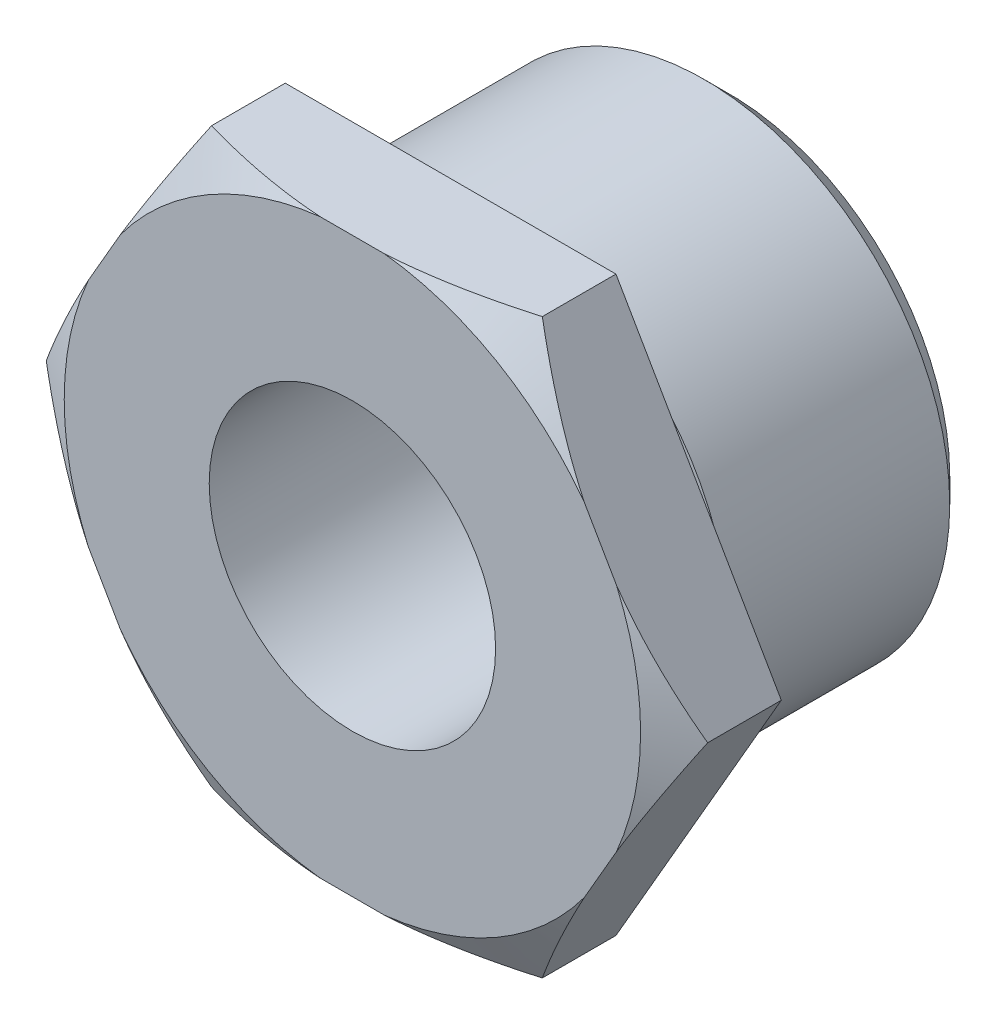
from build123d import *

# Parameters (mm, degrees)
BASE_EXTRUSION_DEPTH    = 6
ESQUISSE4_R             = 8.75
ENL_V_MAT_EXTRU_1_DEPTH = 36.264476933


with BuildPart() as part:
    # Esquisse1 → Base-Extrusion (new body)
    with BuildSketch(Plane.XY):
        Polygon((-20.207259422, 0), (-10.103629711, -17.5), (10.103629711, -17.5), (20.207259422, 0), (10.103629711, 17.5), (-10.103629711, 17.5), align=None)
    extrude(amount=BASE_EXTRUSION_DEPTH)

    # Esquisse2 → Enl_vement de mati_re-R_volution1 (revolve, cut)
    with BuildSketch(Plane(origin=(0, 0, 0), x_dir=(1, 0, 0), z_dir=(0, 1, 0)), mode=Mode.PRIVATE) as enl_vement_de_mati_re_r_volution1_sk:
        Polygon((-20.207259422, -4.5), (-17.60918321, -6), (-20.207259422, -6), align=None)
    revolve(enl_vement_de_mati_re_r_volution1_sk.sketch.rotate(Axis((0, 0, 0), (0, 0, 1)), 180), axis=Axis((0, 0, 0), (0, 0, 1)), mode=Mode.SUBTRACT)

    # Esquisse3 → Boss.-R_vol.1 (revolve)
    with BuildSketch(Plane(origin=(0, 0, 0), x_dir=(0, 0, -1), z_dir=(1, 0, 0)), mode=Mode.PRIVATE) as boss_r_vol_1_sk:
        Polygon((0, 13.5), (2, 13.5), (2, 15), (15.5, 15), (17, 13.5), (17, 0), (0, 0), align=None)
    revolve(boss_r_vol_1_sk.sketch.rotate(Axis((0, 0, 0), (0, 0, -1)), 90), axis=Axis((0, 0, 0), (0, 0, -1)))

    # Esquisse4 → Enl_v. mat.-Extru.1 (cut, through all)
    with BuildSketch(Plane.XY.offset(6)):
        Circle(ESQUISSE4_R)
    extrude(amount=-ENL_V_MAT_EXTRU_1_DEPTH, mode=Mode.SUBTRACT)


solid = part.part
